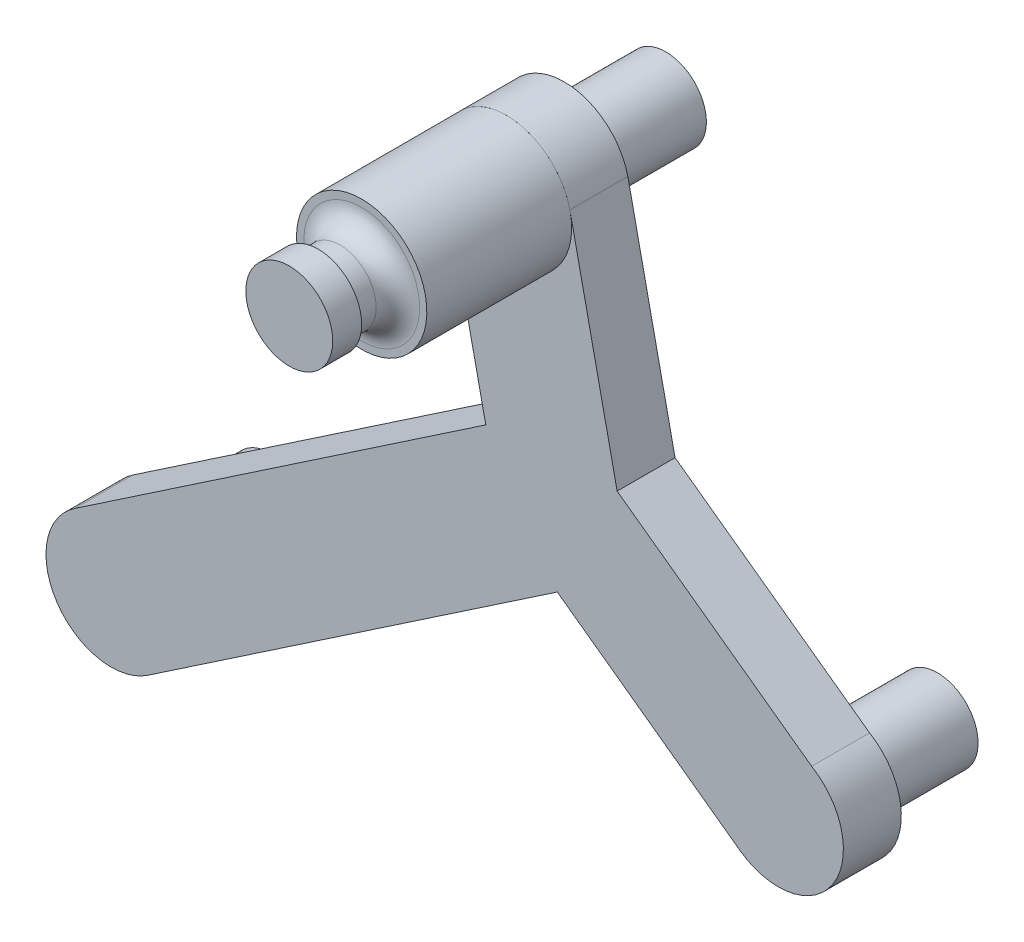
from build123d import *

# Parameters (mm, degrees)
SKETCH1_R             = 4.5
BOSS_EXTRUDE1_DEPTH   = 7
BOSS_EXTRUDE1_2_DEPTH = 7
BOSS_EXTRUDE1_3_DEPTH = 7
BOSS_EXTRUDE2_START   = 4
BOSS_EXTRUDE2_DEPTH   = 4
CUT_EXTRUDE2_START    = -7
SKETCH3_R             = 4.5
SKETCH3_R_2           = 2.8
CUT_EXTRUDE2_DEPTH    = 7
SKETCH4_R             = 2.5
BOSS_EXTRUDE3_DEPTH   = 10
SKETCH4_3_R           = 2.5
BOSS_EXTRUDE5_DEPTH   = 13
SKETCH6_R             = 3
BOSS_EXTRUDE6_DEPTH   = 2
FILLET2_R             = 1.5


with BuildPart() as part:
    # Sketch1 → Boss-Extrude1 (new body)
    with BuildSketch(Plane.XY):
        with Locations((-3.598485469, 16.757036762)):
            Circle(SKETCH1_R)
    extrude(amount=-BOSS_EXTRUDE1_DEPTH)



with BuildPart() as body_2:
    # Sketch1 → Boss-Extrude1 2 (new body)
    with BuildSketch(Plane.XY):
        with Locations((15.163695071, -10.995991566)):
            Circle(SKETCH1_R)
    extrude(amount=-BOSS_EXTRUDE1_2_DEPTH)


with BuildPart() as body_3:
    # Sketch1 → Boss-Extrude1 3 (new body)
    with BuildSketch(Plane.XY):
        with Locations((-30.896240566, -20.887120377)):
            Circle(SKETCH1_R)
    extrude(amount=-BOSS_EXTRUDE1_3_DEPTH)


with BuildPart() as part_1:
    add(part.part)

    add(body_2.part)  # Boss-Extrude2 merges body 2

    add(body_3.part)  # Boss-Extrude2 merges body 3
    # Sketch1_4 → Boss-Extrude2 (add)
    with BuildSketch(Plane.XY.offset(BOSS_EXTRUDE2_START)):
        with BuildLine():
            Line((-5.028922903, 2.032082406), (-33.416533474, -17.159101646))
            ThreePointArc((-33.416533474, -17.159101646), (-34.624259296, -23.407413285), (-28.375947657, -24.615139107))
            Line((-28.375947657, -24.615139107), (-0.090488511, -5.493013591))
            Line((-0.090488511, -5.493013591), (12.521976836, -14.638974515))
            ThreePointArc((12.521976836, -14.638974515), (14.239388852, -15.400041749), (16.117868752, -15.393667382))
            ThreePointArc((16.117868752, -15.393667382), (18.80667802, -13.637709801), (19.640159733, -10.536356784))
            ThreePointArc((19.640159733, -10.536356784), (18.959463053, -8.57893852), (17.473719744, -7.134154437))
            Line((17.473719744, -7.134154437), (4.041883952, 2.605975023))
            Line((4.041883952, 2.605975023), (0.779643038, 17.797224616))
            ThreePointArc((0.779643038, 17.797224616), (-4.445502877, 21.176602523), (-8.050969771, 16.104822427))
            Line((-8.050969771, 16.104822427), (-5.028922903, 2.032082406))
        make_face()
    extrude(amount=-BOSS_EXTRUDE2_DEPTH)

    # Sketch3 → Cut-Extrude2 (cut)
    # profile 1 of 3: a face of its own
    with BuildSketch(Plane(origin=(0, 0, -7), x_dir=(-1, 0, 0), z_dir=(0, 0, -1)).offset(CUT_EXTRUDE2_START)):
        with Locations((3.598485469, 16.757036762)):
            Circle(SKETCH3_R)
        with Locations((3.598485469, 16.757036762)):
            Circle(SKETCH3_R_2, mode=Mode.SUBTRACT)
    # profile 2 of 3: a face of its own
    with BuildSketch(Plane(origin=(0, 0, -7), x_dir=(-1, 0, 0), z_dir=(0, 0, -1)).offset(CUT_EXTRUDE2_START)):
        with Locations((-15.163695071, -10.995991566)):
            Circle(SKETCH3_R)
        with Locations((-15.163695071, -10.995991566)):
            Circle(SKETCH3_R_2, mode=Mode.SUBTRACT)
    # profile 3 of 3: a face of its own
    with BuildSketch(Plane(origin=(0, 0, -7), x_dir=(-1, 0, 0), z_dir=(0, 0, -1)).offset(CUT_EXTRUDE2_START)):
        with Locations((30.896240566, -20.887120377)):
            Circle(SKETCH3_R)
        with Locations((30.896240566, -20.887120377)):
            Circle(SKETCH3_R_2, mode=Mode.SUBTRACT)
    extrude(amount=CUT_EXTRUDE2_DEPTH, mode=Mode.SUBTRACT)

    # Sketch4 → Boss-Extrude3 (add)
    # profile 1 of 2: a face of its own
    with BuildSketch(Plane.XY.offset(4)):
        with BuildLine():
            ThreePointArc((-7.929662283, 15.539930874), (-2.984178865, 12.300236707), (0.900452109, 16.757036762))
            ThreePointArc((0.900452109, 16.757036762), (-3.933613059, 21.243475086), (-8.047495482, 16.088643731))
            Line((-8.047495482, 16.088643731), (-7.929662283, 15.539930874))
        make_face()
        with Locations((-3.598485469, 16.757036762)):
            Circle(SKETCH4_R, mode=Mode.SUBTRACT)
    # profile 2 of 2: a face of its own
    with BuildSketch(Plane.XY.offset(4)):
        with Locations((-3.598485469, 16.757036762)):
            Circle(SKETCH4_R)
    extrude(amount=BOSS_EXTRUDE3_DEPTH)

    # Sketch4_3 → Boss-Extrude5 (add)
    with BuildSketch(Plane.XY.offset(4)):
        with Locations(Location((-3.598485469, 16.757036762, 0), (0, 0, 180))):
            Circle(SKETCH4_3_R)
    extrude(amount=BOSS_EXTRUDE5_DEPTH)

    # Sketch6 → Boss-Extrude6 (add)
    with BuildSketch(Plane.XY.offset(17)):
        with Locations((-3.598485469, 16.757036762)):
            Circle(SKETCH6_R)
    extrude(amount=BOSS_EXTRUDE6_DEPTH)

    # Fillet2
    fillet2_edges = [part_1.edges().sort_by_distance(p)[0] for p in [
        (-1.098485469, 16.757036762, 14),
    ]]
    fillet(fillet2_edges, radius=FILLET2_R)


solid = part_1.part
